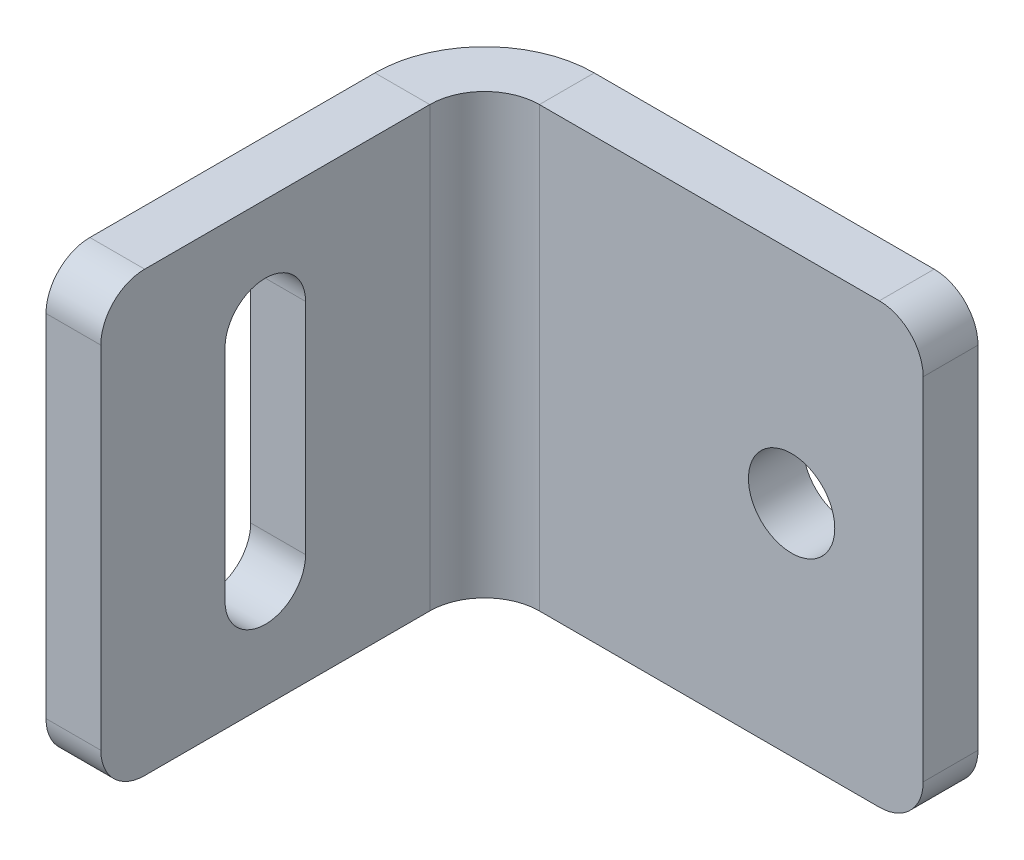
ISO-10303-21;
HEADER;
FILE_DESCRIPTION(('STEP AP214'),'2;1');
FILE_NAME('part.step','',(''),(''),'','','');
FILE_SCHEMA(('AUTOMOTIVE_DESIGN { 1 0 10303 214 1 1 1 1 }'));
ENDSEC;
DATA;
#1=APPLICATION_CONTEXT('core data for automotive mechanical design processes');
#2=APPLICATION_PROTOCOL_DEFINITION('international standard','automotive_design',2000,#1);
#3=PRODUCT_CONTEXT('',#1,'mechanical');
#4=PRODUCT('Part','Part','',(#3));
#5=PRODUCT_RELATED_PRODUCT_CATEGORY('part','',(#4));
#6=PRODUCT_DEFINITION_FORMATION('','',#4);
#7=PRODUCT_DEFINITION_CONTEXT('part definition',#1,'design');
#8=PRODUCT_DEFINITION('design','',#6,#7);
#9=PRODUCT_DEFINITION_SHAPE('','',#8);
#10=(LENGTH_UNIT() NAMED_UNIT(*) SI_UNIT(.MILLI.,.METRE.));
#11=(NAMED_UNIT(*) PLANE_ANGLE_UNIT() SI_UNIT($,.RADIAN.));
#12=(NAMED_UNIT(*) SI_UNIT($,.STERADIAN.) SOLID_ANGLE_UNIT());
#13=UNCERTAINTY_MEASURE_WITH_UNIT(LENGTH_MEASURE(1.E-05),#10,'distance_accuracy_value','');
#14=(GEOMETRIC_REPRESENTATION_CONTEXT(3) GLOBAL_UNCERTAINTY_ASSIGNED_CONTEXT((#13)) GLOBAL_UNIT_ASSIGNED_CONTEXT((#10,
#11,#12)) REPRESENTATION_CONTEXT('',''));
#15=CARTESIAN_POINT('',(0.,0.,0.));
#16=DIRECTION('',(0.,0.,1.));
#17=DIRECTION('',(1.,0.,0.));
#18=AXIS2_PLACEMENT_3D('',#15,#16,#17);
#19=CARTESIAN_POINT('',(11.0458483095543,-22.6108803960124,-3.175));
#20=DIRECTION('',(0.,-1.,0.));
#21=DIRECTION('',(0.,0.,-1.));
#22=AXIS2_PLACEMENT_3D('',#19,#20,#21);
#23=PLANE('',#22);
#24=DIRECTION('',(1.,0.,0.));
#25=VECTOR('',#24,1.);
#26=CARTESIAN_POINT('',(11.0458483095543,-22.6108803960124,-3.175));
#27=LINE('',#26,#25);
#28=CARTESIAN_POINT('',(14.2208483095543,-22.6108803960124,-3.175));
#29=VERTEX_POINT('',#28);
#30=CARTESIAN_POINT('',(33.9058483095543,-22.6108803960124,-3.175));
#31=VERTEX_POINT('',#30);
#32=EDGE_CURVE('E237',#29,#31,#27,.T.);
#33=ORIENTED_EDGE('',*,*,#32,.T.);
#34=DIRECTION('',(0.,0.,1.));
#35=VECTOR('',#34,1.);
#36=CARTESIAN_POINT('',(33.9058483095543,-22.6108803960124,-3.175));
#37=LINE('',#36,#35);
#38=CARTESIAN_POINT('',(33.9058483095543,-22.6108803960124,0.));
#39=VERTEX_POINT('',#38);
#40=EDGE_CURVE('E259',#31,#39,#37,.T.);
#41=ORIENTED_EDGE('',*,*,#40,.T.);
#42=DIRECTION('',(1.,0.,0.));
#43=VECTOR('',#42,1.);
#44=CARTESIAN_POINT('',(11.0458483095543,-22.6108803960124,0.));
#45=LINE('',#44,#43);
#46=CARTESIAN_POINT('',(14.2208483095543,-22.6108803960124,0.));
#47=VERTEX_POINT('',#46);
#48=EDGE_CURVE('E234',#47,#39,#45,.T.);
#49=ORIENTED_EDGE('',*,*,#48,.F.);
#50=DIRECTION('',(0.,0.,-1.));
#51=VECTOR('',#50,1.);
#52=CARTESIAN_POINT('',(14.2208483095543,-22.6108803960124,0.));
#53=LINE('',#52,#51);
#54=EDGE_CURVE('E220',#47,#29,#53,.T.);
#55=ORIENTED_EDGE('',*,*,#54,.T.);
#56=EDGE_LOOP('',(#33,#41,#49,#55));
#57=FACE_BOUND('',#56,.T.);
#58=ADVANCED_FACE('F32',(#57),#23,.T.);
#59=CARTESIAN_POINT('',(11.0458483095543,-22.6108803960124,-3.175));
#60=DIRECTION('',(0.,0.,1.));
#61=DIRECTION('',(1.,0.,0.));
#62=AXIS2_PLACEMENT_3D('',#59,#60,#61);
#63=PLANE('',#62);
#64=CARTESIAN_POINT('',(28.8258483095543,-9.91088039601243,-3.175));
#65=DIRECTION('',(0.,0.,1.));
#66=DIRECTION('',(1.,0.,0.));
#67=AXIS2_PLACEMENT_3D('',#64,#65,#66);
#68=CIRCLE('',#67,2.49999999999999);
#69=CARTESIAN_POINT('',(31.3258483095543,-9.91088039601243,-3.175));
#70=VERTEX_POINT('',#69);
#71=EDGE_CURVE('E183',#70,#70,#68,.T.);
#72=ORIENTED_EDGE('',*,*,#71,.T.);
#73=EDGE_LOOP('',(#72));
#74=FACE_BOUND('',#73,.T.);
#75=DIRECTION('',(0.,1.,0.));
#76=VECTOR('',#75,1.);
#77=CARTESIAN_POINT('',(36.4458483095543,2.78911960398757,-3.175));
#78=LINE('',#77,#76);
#79=CARTESIAN_POINT('',(36.4458483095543,-20.0708803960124,-3.175));
#80=VERTEX_POINT('',#79);
#81=CARTESIAN_POINT('',(36.4458483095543,0.249119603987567,-3.175));
#82=VERTEX_POINT('',#81);
#83=EDGE_CURVE('E240',#80,#82,#78,.T.);
#84=ORIENTED_EDGE('',*,*,#83,.F.);
#85=CARTESIAN_POINT('',(33.9058483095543,-20.0708803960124,-3.175));
#86=DIRECTION('',(0.,0.,1.));
#87=DIRECTION('',(1.,0.,0.));
#88=AXIS2_PLACEMENT_3D('',#85,#86,#87);
#89=CIRCLE('',#88,2.54);
#90=EDGE_CURVE('E273',#80,#31,#89,.F.);
#91=ORIENTED_EDGE('',*,*,#90,.T.);
#92=ORIENTED_EDGE('',*,*,#32,.F.);
#93=DIRECTION('',(0.,-1.,0.));
#94=VECTOR('',#93,1.);
#95=CARTESIAN_POINT('',(14.2208483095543,-22.6108803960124,-3.175));
#96=LINE('',#95,#94);
#97=CARTESIAN_POINT('',(14.2208483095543,2.78911960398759,-3.175));
#98=VERTEX_POINT('',#97);
#99=EDGE_CURVE('E213',#29,#98,#96,.F.);
#100=ORIENTED_EDGE('',*,*,#99,.T.);
#101=DIRECTION('',(-1.,0.,0.));
#102=VECTOR('',#101,1.);
#103=CARTESIAN_POINT('',(11.0458483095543,2.78911960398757,-3.175));
#104=LINE('',#103,#102);
#105=CARTESIAN_POINT('',(33.9058483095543,2.78911960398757,-3.175));
#106=VERTEX_POINT('',#105);
#107=EDGE_CURVE('E244',#106,#98,#104,.T.);
#108=ORIENTED_EDGE('',*,*,#107,.F.);
#109=CARTESIAN_POINT('',(33.9058483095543,0.249119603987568,-3.175));
#110=DIRECTION('',(0.,0.,1.));
#111=DIRECTION('',(1.,0.,0.));
#112=AXIS2_PLACEMENT_3D('',#109,#110,#111);
#113=CIRCLE('',#112,2.54);
#114=EDGE_CURVE('E271',#106,#82,#113,.F.);
#115=ORIENTED_EDGE('',*,*,#114,.T.);
#116=EDGE_LOOP('',(#84,#91,#92,#100,#108,#115));
#117=FACE_BOUND('',#116,.T.);
#118=ADVANCED_FACE('F345',(#74,#117),#63,.F.);
#119=CARTESIAN_POINT('',(11.0458483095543,-22.6108803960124,0.));
#120=DIRECTION('',(0.,0.,1.));
#121=DIRECTION('',(1.,0.,0.));
#122=AXIS2_PLACEMENT_3D('',#119,#120,#121);
#123=PLANE('',#122);
#124=CARTESIAN_POINT('',(28.8258483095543,-9.91088039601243,0.));
#125=DIRECTION('',(0.,0.,1.));
#126=DIRECTION('',(1.,0.,0.));
#127=AXIS2_PLACEMENT_3D('',#124,#125,#126);
#128=CIRCLE('',#127,2.49999999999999);
#129=CARTESIAN_POINT('',(31.3258483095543,-9.91088039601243,0.));
#130=VERTEX_POINT('',#129);
#131=EDGE_CURVE('E180',#130,#130,#128,.T.);
#132=ORIENTED_EDGE('',*,*,#131,.F.);
#133=EDGE_LOOP('',(#132));
#134=FACE_BOUND('',#133,.T.);
#135=ORIENTED_EDGE('',*,*,#48,.T.);
#136=CARTESIAN_POINT('',(33.9058483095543,-20.0708803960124,0.));
#137=DIRECTION('',(0.,0.,1.));
#138=DIRECTION('',(1.,0.,0.));
#139=AXIS2_PLACEMENT_3D('',#136,#137,#138);
#140=CIRCLE('',#139,2.54);
#141=CARTESIAN_POINT('',(36.4458483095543,-20.0708803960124,0.));
#142=VERTEX_POINT('',#141);
#143=EDGE_CURVE('E264',#39,#142,#140,.T.);
#144=ORIENTED_EDGE('',*,*,#143,.T.);
#145=DIRECTION('',(0.,1.,0.));
#146=VECTOR('',#145,1.);
#147=CARTESIAN_POINT('',(36.4458483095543,2.78911960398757,0.));
#148=LINE('',#147,#146);
#149=CARTESIAN_POINT('',(36.4458483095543,0.249119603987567,0.));
#150=VERTEX_POINT('',#149);
#151=EDGE_CURVE('E249',#142,#150,#148,.T.);
#152=ORIENTED_EDGE('',*,*,#151,.T.);
#153=CARTESIAN_POINT('',(33.9058483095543,0.249119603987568,0.));
#154=DIRECTION('',(0.,0.,1.));
#155=DIRECTION('',(1.,0.,0.));
#156=AXIS2_PLACEMENT_3D('',#153,#154,#155);
#157=CIRCLE('',#156,2.54);
#158=CARTESIAN_POINT('',(33.9058483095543,2.78911960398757,0.));
#159=VERTEX_POINT('',#158);
#160=EDGE_CURVE('E262',#150,#159,#157,.T.);
#161=ORIENTED_EDGE('',*,*,#160,.T.);
#162=DIRECTION('',(-1.,0.,0.));
#163=VECTOR('',#162,1.);
#164=CARTESIAN_POINT('',(11.0458483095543,2.78911960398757,0.));
#165=LINE('',#164,#163);
#166=CARTESIAN_POINT('',(14.2208483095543,2.78911960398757,0.));
#167=VERTEX_POINT('',#166);
#168=EDGE_CURVE('E241',#159,#167,#165,.T.);
#169=ORIENTED_EDGE('',*,*,#168,.T.);
#170=DIRECTION('',(0.,-1.,0.));
#171=VECTOR('',#170,1.);
#172=CARTESIAN_POINT('',(14.2208483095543,-22.6108803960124,0.));
#173=LINE('',#172,#171);
#174=EDGE_CURVE('E226',#47,#167,#173,.F.);
#175=ORIENTED_EDGE('',*,*,#174,.F.);
#176=EDGE_LOOP('',(#135,#144,#152,#161,#169,#175));
#177=FACE_BOUND('',#176,.T.);
#178=ADVANCED_FACE('F324',(#134,#177),#123,.T.);
#179=CARTESIAN_POINT('',(11.0458483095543,2.78911960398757,-3.175));
#180=DIRECTION('',(0.,1.,0.));
#181=DIRECTION('',(0.,0.,1.));
#182=AXIS2_PLACEMENT_3D('',#179,#180,#181);
#183=PLANE('',#182);
#184=ORIENTED_EDGE('',*,*,#168,.F.);
#185=DIRECTION('',(0.,0.,1.));
#186=VECTOR('',#185,1.);
#187=CARTESIAN_POINT('',(33.9058483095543,2.78911960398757,-3.175));
#188=LINE('',#187,#186);
#189=EDGE_CURVE('E275',#159,#106,#188,.F.);
#190=ORIENTED_EDGE('',*,*,#189,.T.);
#191=ORIENTED_EDGE('',*,*,#107,.T.);
#192=DIRECTION('',(0.,0.,-1.));
#193=VECTOR('',#192,1.);
#194=CARTESIAN_POINT('',(14.2208483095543,2.78911960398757,0.));
#195=LINE('',#194,#193);
#196=EDGE_CURVE('E231',#167,#98,#195,.T.);
#197=ORIENTED_EDGE('',*,*,#196,.F.);
#198=EDGE_LOOP('',(#184,#190,#191,#197));
#199=FACE_BOUND('',#198,.T.);
#200=ADVANCED_FACE('F342',(#199),#183,.T.);
#201=CARTESIAN_POINT('',(36.4458483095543,2.78911960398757,-3.175));
#202=DIRECTION('',(1.,0.,0.));
#203=DIRECTION('',(0.,1.,0.));
#204=AXIS2_PLACEMENT_3D('',#201,#202,#203);
#205=PLANE('',#204);
#206=ORIENTED_EDGE('',*,*,#151,.F.);
#207=DIRECTION('',(0.,0.,1.));
#208=VECTOR('',#207,1.);
#209=CARTESIAN_POINT('',(36.4458483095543,-20.0708803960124,-3.175));
#210=LINE('',#209,#208);
#211=EDGE_CURVE('E269',#142,#80,#210,.F.);
#212=ORIENTED_EDGE('',*,*,#211,.T.);
#213=ORIENTED_EDGE('',*,*,#83,.T.);
#214=DIRECTION('',(0.,0.,1.));
#215=VECTOR('',#214,1.);
#216=CARTESIAN_POINT('',(36.4458483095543,0.249119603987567,-3.175));
#217=LINE('',#216,#215);
#218=EDGE_CURVE('E266',#82,#150,#217,.T.);
#219=ORIENTED_EDGE('',*,*,#218,.T.);
#220=EDGE_LOOP('',(#206,#212,#213,#219));
#221=FACE_BOUND('',#220,.T.);
#222=ADVANCED_FACE('F334',(#221),#205,.T.);
#223=CARTESIAN_POINT('',(14.2208483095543,2.78911960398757,3.175));
#224=DIRECTION('',(0.,1.,0.));
#225=DIRECTION('',(0.,0.,1.));
#226=AXIS2_PLACEMENT_3D('',#223,#224,#225);
#227=PLANE('',#226);
#228=DIRECTION('',(-1.,0.,0.));
#229=VECTOR('',#228,1.);
#230=CARTESIAN_POINT('',(11.0458483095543,2.78911960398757,3.17499999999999));
#231=LINE('',#230,#229);
#232=CARTESIAN_POINT('',(11.0458483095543,2.78911960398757,3.17499999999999));
#233=VERTEX_POINT('',#232);
#234=CARTESIAN_POINT('',(7.8708483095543,2.78911960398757,3.17499999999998));
#235=VERTEX_POINT('',#234);
#236=EDGE_CURVE('E186',#233,#235,#231,.T.);
#237=ORIENTED_EDGE('',*,*,#236,.F.);
#238=CARTESIAN_POINT('',(14.2208483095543,2.78911960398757,3.175));
#239=DIRECTION('',(0.,-1.,0.));
#240=DIRECTION('',(0.,0.,-1.));
#241=AXIS2_PLACEMENT_3D('',#238,#239,#240);
#242=CIRCLE('',#241,3.175);
#243=EDGE_CURVE('E223',#167,#233,#242,.F.);
#244=ORIENTED_EDGE('',*,*,#243,.F.);
#245=ORIENTED_EDGE('',*,*,#196,.T.);
#246=CARTESIAN_POINT('',(14.2208483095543,2.78911960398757,3.175));
#247=DIRECTION('',(0.,-1.,0.));
#248=DIRECTION('',(0.,0.,-1.));
#249=AXIS2_PLACEMENT_3D('',#246,#247,#248);
#250=CIRCLE('',#249,6.35);
#251=EDGE_CURVE('E216',#98,#235,#250,.F.);
#252=ORIENTED_EDGE('',*,*,#251,.T.);
#253=EDGE_LOOP('',(#237,#244,#245,#252));
#254=FACE_BOUND('',#253,.T.);
#255=ADVANCED_FACE('F313',(#254),#227,.T.);
#256=CARTESIAN_POINT('',(14.2208483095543,-22.6108803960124,3.175));
#257=DIRECTION('',(0.,1.,0.));
#258=DIRECTION('',(0.,0.,1.));
#259=AXIS2_PLACEMENT_3D('',#256,#257,#258);
#260=PLANE('',#259);
#261=CARTESIAN_POINT('',(14.2208483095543,-22.6108803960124,3.175));
#262=DIRECTION('',(0.,-1.,0.));
#263=DIRECTION('',(0.,0.,-1.));
#264=AXIS2_PLACEMENT_3D('',#261,#262,#263);
#265=CIRCLE('',#264,3.175);
#266=CARTESIAN_POINT('',(11.0458483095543,-22.6108803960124,3.17499999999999));
#267=VERTEX_POINT('',#266);
#268=EDGE_CURVE('E207',#267,#47,#265,.T.);
#269=ORIENTED_EDGE('',*,*,#268,.F.);
#270=DIRECTION('',(-1.,0.,0.));
#271=VECTOR('',#270,1.);
#272=CARTESIAN_POINT('',(11.0458483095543,-22.6108803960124,3.17499999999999));
#273=LINE('',#272,#271);
#274=CARTESIAN_POINT('',(7.8708483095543,-22.6108803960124,3.17499999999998));
#275=VERTEX_POINT('',#274);
#276=EDGE_CURVE('E191',#267,#275,#273,.T.);
#277=ORIENTED_EDGE('',*,*,#276,.T.);
#278=CARTESIAN_POINT('',(14.2208483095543,-22.6108803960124,3.175));
#279=DIRECTION('',(0.,-1.,0.));
#280=DIRECTION('',(0.,0.,-1.));
#281=AXIS2_PLACEMENT_3D('',#278,#279,#280);
#282=CIRCLE('',#281,6.35);
#283=EDGE_CURVE('E217',#275,#29,#282,.T.);
#284=ORIENTED_EDGE('',*,*,#283,.T.);
#285=ORIENTED_EDGE('',*,*,#54,.F.);
#286=EDGE_LOOP('',(#269,#277,#284,#285));
#287=FACE_BOUND('',#286,.T.);
#288=ADVANCED_FACE('F305',(#287),#260,.F.);
#289=CARTESIAN_POINT('',(14.2208483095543,-22.6108803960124,3.175));
#290=DIRECTION('',(0.,-1.,0.));
#291=DIRECTION('',(-1.,0.,0.));
#292=AXIS2_PLACEMENT_3D('',#289,#290,#291);
#293=CYLINDRICAL_SURFACE('',#292,6.35);
#294=ORIENTED_EDGE('',*,*,#99,.F.);
#295=ORIENTED_EDGE('',*,*,#283,.F.);
#296=DIRECTION('',(0.,1.,0.));
#297=VECTOR('',#296,1.);
#298=CARTESIAN_POINT('',(7.8708483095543,-22.6108803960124,3.17499999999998));
#299=LINE('',#298,#297);
#300=EDGE_CURVE('E194',#275,#235,#299,.T.);
#301=ORIENTED_EDGE('',*,*,#300,.T.);
#302=ORIENTED_EDGE('',*,*,#251,.F.);
#303=EDGE_LOOP('',(#294,#295,#301,#302));
#304=FACE_BOUND('',#303,.T.);
#305=ADVANCED_FACE('F310',(#304),#293,.T.);
#306=CARTESIAN_POINT('',(14.2208483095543,-22.6108803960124,3.175));
#307=DIRECTION('',(0.,-1.,0.));
#308=DIRECTION('',(-1.,0.,0.));
#309=AXIS2_PLACEMENT_3D('',#306,#307,#308);
#310=CYLINDRICAL_SURFACE('',#309,3.175);
#311=ORIENTED_EDGE('',*,*,#174,.T.);
#312=ORIENTED_EDGE('',*,*,#243,.T.);
#313=DIRECTION('',(0.,-1.,0.));
#314=VECTOR('',#313,1.);
#315=CARTESIAN_POINT('',(11.0458483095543,2.78911960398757,3.17499999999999));
#316=LINE('',#315,#314);
#317=EDGE_CURVE('E189',#233,#267,#316,.T.);
#318=ORIENTED_EDGE('',*,*,#317,.T.);
#319=ORIENTED_EDGE('',*,*,#268,.T.);
#320=EDGE_LOOP('',(#311,#312,#318,#319));
#321=FACE_BOUND('',#320,.T.);
#322=ADVANCED_FACE('F321',(#321),#310,.F.);
#323=CARTESIAN_POINT('',(7.87084830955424,-22.6108803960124,22.225));
#324=DIRECTION('',(0.,1.,0.));
#325=DIRECTION('',(0.,0.,1.));
#326=AXIS2_PLACEMENT_3D('',#323,#324,#325);
#327=PLANE('',#326);
#328=DIRECTION('',(0.,0.,1.));
#329=VECTOR('',#328,1.);
#330=CARTESIAN_POINT('',(11.0458483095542,-22.6108803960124,22.225));
#331=LINE('',#330,#329);
#332=CARTESIAN_POINT('',(11.0458483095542,-22.6108803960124,19.685));
#333=VERTEX_POINT('',#332);
#334=EDGE_CURVE('E199',#267,#333,#331,.T.);
#335=ORIENTED_EDGE('',*,*,#334,.T.);
#336=DIRECTION('',(1.,0.,0.));
#337=VECTOR('',#336,1.);
#338=CARTESIAN_POINT('',(7.87084830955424,-22.6108803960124,19.685));
#339=LINE('',#338,#337);
#340=CARTESIAN_POINT('',(7.87084830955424,-22.6108803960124,19.685));
#341=VERTEX_POINT('',#340);
#342=EDGE_CURVE('E55',#333,#341,#339,.F.);
#343=ORIENTED_EDGE('',*,*,#342,.T.);
#344=DIRECTION('',(0.,0.,1.));
#345=VECTOR('',#344,1.);
#346=CARTESIAN_POINT('',(7.87084830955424,-22.6108803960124,22.225));
#347=LINE('',#346,#345);
#348=EDGE_CURVE('E200',#275,#341,#347,.T.);
#349=ORIENTED_EDGE('',*,*,#348,.F.);
#350=ORIENTED_EDGE('',*,*,#276,.F.);
#351=EDGE_LOOP('',(#335,#343,#349,#350));
#352=FACE_BOUND('',#351,.T.);
#353=ADVANCED_FACE('F302',(#352),#327,.F.);
#354=CARTESIAN_POINT('',(7.87084830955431,2.78911960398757,0.));
#355=DIRECTION('',(0.,-1.,0.));
#356=DIRECTION('',(0.,0.,-1.));
#357=AXIS2_PLACEMENT_3D('',#354,#355,#356);
#358=PLANE('',#357);
#359=DIRECTION('',(0.,0.,-1.));
#360=VECTOR('',#359,1.);
#361=CARTESIAN_POINT('',(7.87084830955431,2.78911960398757,0.));
#362=LINE('',#361,#360);
#363=CARTESIAN_POINT('',(7.87084830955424,2.78911960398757,19.685));
#364=VERTEX_POINT('',#363);
#365=EDGE_CURVE('E205',#364,#235,#362,.T.);
#366=ORIENTED_EDGE('',*,*,#365,.F.);
#367=DIRECTION('',(1.,0.,0.));
#368=VECTOR('',#367,1.);
#369=CARTESIAN_POINT('',(7.87084830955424,2.78911960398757,19.685));
#370=LINE('',#369,#368);
#371=CARTESIAN_POINT('',(11.0458483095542,2.78911960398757,19.685));
#372=VERTEX_POINT('',#371);
#373=EDGE_CURVE('E11',#364,#372,#370,.T.);
#374=ORIENTED_EDGE('',*,*,#373,.T.);
#375=DIRECTION('',(0.,0.,-1.));
#376=VECTOR('',#375,1.);
#377=CARTESIAN_POINT('',(11.0458483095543,2.78911960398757,0.));
#378=LINE('',#377,#376);
#379=EDGE_CURVE('E203',#372,#233,#378,.T.);
#380=ORIENTED_EDGE('',*,*,#379,.T.);
#381=ORIENTED_EDGE('',*,*,#236,.T.);
#382=EDGE_LOOP('',(#366,#374,#380,#381));
#383=FACE_BOUND('',#382,.T.);
#384=ADVANCED_FACE('F317',(#383),#358,.F.);
#385=CARTESIAN_POINT('',(7.87084830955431,-22.6108803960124,0.));
#386=DIRECTION('',(1.,0.,0.));
#387=DIRECTION('',(0.,0.,-1.));
#388=AXIS2_PLACEMENT_3D('',#385,#386,#387);
#389=PLANE('',#388);
#390=DIRECTION('',(0.,-1.,0.));
#391=VECTOR('',#390,1.);
#392=CARTESIAN_POINT('',(7.87084830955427,-3.48822162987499,10.3675520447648));
#393=LINE('',#392,#391);
#394=CARTESIAN_POINT('',(7.87084830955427,-3.48822162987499,10.3675520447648));
#395=VERTEX_POINT('',#394);
#396=CARTESIAN_POINT('',(7.87084830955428,-16.188221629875,10.3675520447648));
#397=VERTEX_POINT('',#396);
#398=EDGE_CURVE('E164',#395,#397,#393,.T.);
#399=ORIENTED_EDGE('',*,*,#398,.F.);
#400=CARTESIAN_POINT('',(7.87084830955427,-3.48822162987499,12.7000000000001));
#401=DIRECTION('',(-1.,0.,0.));
#402=DIRECTION('',(0.,0.,1.));
#403=AXIS2_PLACEMENT_3D('',#400,#401,#402);
#404=CIRCLE('',#403,2.33244795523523);
#405=CARTESIAN_POINT('',(7.87084830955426,-3.48822162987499,15.0324479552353));
#406=VERTEX_POINT('',#405);
#407=EDGE_CURVE('E169',#406,#395,#404,.T.);
#408=ORIENTED_EDGE('',*,*,#407,.F.);
#409=DIRECTION('',(0.,1.,0.));
#410=VECTOR('',#409,1.);
#411=CARTESIAN_POINT('',(7.87084830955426,-3.48822162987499,15.0324479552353));
#412=LINE('',#411,#410);
#413=CARTESIAN_POINT('',(7.87084830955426,-16.188221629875,15.0324479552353));
#414=VERTEX_POINT('',#413);
#415=EDGE_CURVE('E173',#414,#406,#412,.T.);
#416=ORIENTED_EDGE('',*,*,#415,.F.);
#417=CARTESIAN_POINT('',(7.87084830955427,-16.188221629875,12.7000000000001));
#418=DIRECTION('',(-1.,0.,0.));
#419=DIRECTION('',(0.,0.,1.));
#420=AXIS2_PLACEMENT_3D('',#417,#418,#419);
#421=CIRCLE('',#420,2.33244795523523);
#422=EDGE_CURVE('E153',#397,#414,#421,.T.);
#423=ORIENTED_EDGE('',*,*,#422,.F.);
#424=EDGE_LOOP('',(#399,#408,#416,#423));
#425=FACE_BOUND('',#424,.T.);
#426=ORIENTED_EDGE('',*,*,#348,.T.);
#427=CARTESIAN_POINT('',(7.87084830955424,-20.0708803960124,19.685));
#428=DIRECTION('',(1.,0.,0.));
#429=DIRECTION('',(0.,0.,-1.));
#430=AXIS2_PLACEMENT_3D('',#427,#428,#429);
#431=CIRCLE('',#430,2.54);
#432=CARTESIAN_POINT('',(7.87084830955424,-20.0708803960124,22.225));
#433=VERTEX_POINT('',#432);
#434=EDGE_CURVE('E40',#341,#433,#431,.F.);
#435=ORIENTED_EDGE('',*,*,#434,.T.);
#436=DIRECTION('',(0.,1.,0.));
#437=VECTOR('',#436,1.);
#438=CARTESIAN_POINT('',(7.87084830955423,2.78911960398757,22.225));
#439=LINE('',#438,#437);
#440=CARTESIAN_POINT('',(7.87084830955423,0.24911960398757,22.225));
#441=VERTEX_POINT('',#440);
#442=EDGE_CURVE('E202',#433,#441,#439,.T.);
#443=ORIENTED_EDGE('',*,*,#442,.T.);
#444=CARTESIAN_POINT('',(7.87084830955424,0.24911960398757,19.685));
#445=DIRECTION('',(1.,0.,0.));
#446=DIRECTION('',(0.,0.,-1.));
#447=AXIS2_PLACEMENT_3D('',#444,#445,#446);
#448=CIRCLE('',#447,2.54);
#449=EDGE_CURVE('E47',#441,#364,#448,.F.);
#450=ORIENTED_EDGE('',*,*,#449,.T.);
#451=ORIENTED_EDGE('',*,*,#365,.T.);
#452=ORIENTED_EDGE('',*,*,#300,.F.);
#453=EDGE_LOOP('',(#426,#435,#443,#450,#451,#452));
#454=FACE_BOUND('',#453,.T.);
#455=ADVANCED_FACE('F171',(#425,#454),#389,.F.);
#456=CARTESIAN_POINT('',(11.0458483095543,-22.6108803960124,0.));
#457=DIRECTION('',(1.,0.,0.));
#458=DIRECTION('',(0.,0.,-1.));
#459=AXIS2_PLACEMENT_3D('',#456,#457,#458);
#460=PLANE('',#459);
#461=CARTESIAN_POINT('',(11.0458483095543,-3.48822162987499,12.7000000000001));
#462=DIRECTION('',(1.,0.,0.));
#463=DIRECTION('',(0.,0.,-1.));
#464=AXIS2_PLACEMENT_3D('',#461,#462,#463);
#465=CIRCLE('',#464,2.33244795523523);
#466=CARTESIAN_POINT('',(11.0458483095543,-3.48822162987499,10.3675520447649));
#467=VERTEX_POINT('',#466);
#468=CARTESIAN_POINT('',(11.0458483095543,-3.48822162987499,15.0324479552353));
#469=VERTEX_POINT('',#468);
#470=EDGE_CURVE('E257',#467,#469,#465,.T.);
#471=ORIENTED_EDGE('',*,*,#470,.F.);
#472=DIRECTION('',(0.,1.,0.));
#473=VECTOR('',#472,1.);
#474=CARTESIAN_POINT('',(11.0458483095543,-22.6108803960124,10.3675520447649));
#475=LINE('',#474,#473);
#476=CARTESIAN_POINT('',(11.0458483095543,-16.188221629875,10.3675520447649));
#477=VERTEX_POINT('',#476);
#478=EDGE_CURVE('E246',#477,#467,#475,.T.);
#479=ORIENTED_EDGE('',*,*,#478,.F.);
#480=CARTESIAN_POINT('',(11.0458483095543,-16.188221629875,12.7000000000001));
#481=DIRECTION('',(1.,0.,0.));
#482=DIRECTION('',(0.,0.,-1.));
#483=AXIS2_PLACEMENT_3D('',#480,#481,#482);
#484=CIRCLE('',#483,2.33244795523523);
#485=CARTESIAN_POINT('',(11.0458483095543,-16.188221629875,15.0324479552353));
#486=VERTEX_POINT('',#485);
#487=EDGE_CURVE('E156',#486,#477,#484,.T.);
#488=ORIENTED_EDGE('',*,*,#487,.F.);
#489=DIRECTION('',(0.,-1.,0.));
#490=VECTOR('',#489,1.);
#491=CARTESIAN_POINT('',(11.0458483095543,-22.6108803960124,15.0324479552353));
#492=LINE('',#491,#490);
#493=EDGE_CURVE('E255',#469,#486,#492,.T.);
#494=ORIENTED_EDGE('',*,*,#493,.F.);
#495=EDGE_LOOP('',(#471,#479,#488,#494));
#496=FACE_BOUND('',#495,.T.);
#497=DIRECTION('',(0.,1.,0.));
#498=VECTOR('',#497,1.);
#499=CARTESIAN_POINT('',(11.0458483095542,2.78911960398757,22.225));
#500=LINE('',#499,#498);
#501=CARTESIAN_POINT('',(11.0458483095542,-20.0708803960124,22.225));
#502=VERTEX_POINT('',#501);
#503=CARTESIAN_POINT('',(11.0458483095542,0.249119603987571,22.225));
#504=VERTEX_POINT('',#503);
#505=EDGE_CURVE('E209',#502,#504,#500,.T.);
#506=ORIENTED_EDGE('',*,*,#505,.F.);
#507=CARTESIAN_POINT('',(11.0458483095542,-20.0708803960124,19.685));
#508=DIRECTION('',(1.,0.,0.));
#509=DIRECTION('',(0.,0.,-1.));
#510=AXIS2_PLACEMENT_3D('',#507,#508,#509);
#511=CIRCLE('',#510,2.54);
#512=EDGE_CURVE('E284',#502,#333,#511,.T.);
#513=ORIENTED_EDGE('',*,*,#512,.T.);
#514=ORIENTED_EDGE('',*,*,#334,.F.);
#515=ORIENTED_EDGE('',*,*,#317,.F.);
#516=ORIENTED_EDGE('',*,*,#379,.F.);
#517=CARTESIAN_POINT('',(11.0458483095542,0.249119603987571,19.685));
#518=DIRECTION('',(1.,0.,0.));
#519=DIRECTION('',(0.,0.,-1.));
#520=AXIS2_PLACEMENT_3D('',#517,#518,#519);
#521=CIRCLE('',#520,2.54);
#522=EDGE_CURVE('E282',#372,#504,#521,.T.);
#523=ORIENTED_EDGE('',*,*,#522,.T.);
#524=EDGE_LOOP('',(#506,#513,#514,#515,#516,#523));
#525=FACE_BOUND('',#524,.T.);
#526=ADVANCED_FACE('F299',(#496,#525),#460,.T.);
#527=CARTESIAN_POINT('',(7.87084830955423,2.78911960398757,22.225));
#528=DIRECTION('',(0.,0.,-1.));
#529=DIRECTION('',(-1.,0.,0.));
#530=AXIS2_PLACEMENT_3D('',#527,#528,#529);
#531=PLANE('',#530);
#532=ORIENTED_EDGE('',*,*,#442,.F.);
#533=DIRECTION('',(1.,0.,0.));
#534=VECTOR('',#533,1.);
#535=CARTESIAN_POINT('',(7.87084830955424,-20.0708803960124,22.225));
#536=LINE('',#535,#534);
#537=EDGE_CURVE('E279',#433,#502,#536,.T.);
#538=ORIENTED_EDGE('',*,*,#537,.T.);
#539=ORIENTED_EDGE('',*,*,#505,.T.);
#540=DIRECTION('',(1.,0.,0.));
#541=VECTOR('',#540,1.);
#542=CARTESIAN_POINT('',(7.87084830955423,0.24911960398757,22.225));
#543=LINE('',#542,#541);
#544=EDGE_CURVE('E277',#504,#441,#543,.F.);
#545=ORIENTED_EDGE('',*,*,#544,.T.);
#546=EDGE_LOOP('',(#532,#538,#539,#545));
#547=FACE_BOUND('',#546,.T.);
#548=ADVANCED_FACE('F293',(#547),#531,.F.);
#549=CARTESIAN_POINT('',(28.8258483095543,-9.91088039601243,-3.175));
#550=DIRECTION('',(0.,0.,1.));
#551=DIRECTION('',(1.,0.,0.));
#552=AXIS2_PLACEMENT_3D('',#549,#550,#551);
#553=CYLINDRICAL_SURFACE('',#552,2.49999999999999);
#554=ORIENTED_EDGE('',*,*,#71,.F.);
#555=EDGE_LOOP('',(#554));
#556=FACE_BOUND('',#555,.T.);
#557=ORIENTED_EDGE('',*,*,#131,.T.);
#558=EDGE_LOOP('',(#557));
#559=FACE_BOUND('',#558,.T.);
#560=ADVANCED_FACE('F400',(#556,#559),#553,.F.);
#561=CARTESIAN_POINT('',(36.4458483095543,-3.48822162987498,12.7000000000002));
#562=DIRECTION('',(-1.,0.,0.));
#563=DIRECTION('',(0.,0.,1.));
#564=AXIS2_PLACEMENT_3D('',#561,#562,#563);
#565=CYLINDRICAL_SURFACE('',#564,2.33244795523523);
#566=ORIENTED_EDGE('',*,*,#470,.T.);
#567=DIRECTION('',(-1.,0.,0.));
#568=VECTOR('',#567,1.);
#569=CARTESIAN_POINT('',(36.4458483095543,-3.48822162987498,15.0324479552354));
#570=LINE('',#569,#568);
#571=EDGE_CURVE('E178',#469,#406,#570,.T.);
#572=ORIENTED_EDGE('',*,*,#571,.T.);
#573=ORIENTED_EDGE('',*,*,#407,.T.);
#574=DIRECTION('',(-1.,0.,0.));
#575=VECTOR('',#574,1.);
#576=CARTESIAN_POINT('',(36.4458483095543,-3.48822162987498,10.3675520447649));
#577=LINE('',#576,#575);
#578=EDGE_CURVE('E160',#467,#395,#577,.T.);
#579=ORIENTED_EDGE('',*,*,#578,.F.);
#580=EDGE_LOOP('',(#566,#572,#573,#579));
#581=FACE_BOUND('',#580,.T.);
#582=ADVANCED_FACE('F498',(#581),#565,.F.);
#583=CARTESIAN_POINT('',(36.4458483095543,-3.48822162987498,15.0324479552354));
#584=DIRECTION('',(0.,0.,1.));
#585=DIRECTION('',(1.,0.,0.));
#586=AXIS2_PLACEMENT_3D('',#583,#584,#585);
#587=PLANE('',#586);
#588=ORIENTED_EDGE('',*,*,#493,.T.);
#589=DIRECTION('',(-1.,0.,0.));
#590=VECTOR('',#589,1.);
#591=CARTESIAN_POINT('',(36.4458483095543,-16.188221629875,15.0324479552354));
#592=LINE('',#591,#590);
#593=EDGE_CURVE('E159',#486,#414,#592,.T.);
#594=ORIENTED_EDGE('',*,*,#593,.T.);
#595=ORIENTED_EDGE('',*,*,#415,.T.);
#596=ORIENTED_EDGE('',*,*,#571,.F.);
#597=EDGE_LOOP('',(#588,#594,#595,#596));
#598=FACE_BOUND('',#597,.T.);
#599=ADVANCED_FACE('F489',(#598),#587,.F.);
#600=CARTESIAN_POINT('',(36.4458483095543,-16.188221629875,12.7000000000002));
#601=DIRECTION('',(-1.,0.,0.));
#602=DIRECTION('',(0.,0.,1.));
#603=AXIS2_PLACEMENT_3D('',#600,#601,#602);
#604=CYLINDRICAL_SURFACE('',#603,2.33244795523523);
#605=ORIENTED_EDGE('',*,*,#487,.T.);
#606=DIRECTION('',(-1.,0.,0.));
#607=VECTOR('',#606,1.);
#608=CARTESIAN_POINT('',(36.4458483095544,-16.188221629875,10.3675520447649));
#609=LINE('',#608,#607);
#610=EDGE_CURVE('E148',#477,#397,#609,.T.);
#611=ORIENTED_EDGE('',*,*,#610,.T.);
#612=ORIENTED_EDGE('',*,*,#422,.T.);
#613=ORIENTED_EDGE('',*,*,#593,.F.);
#614=EDGE_LOOP('',(#605,#611,#612,#613));
#615=FACE_BOUND('',#614,.T.);
#616=ADVANCED_FACE('F150',(#615),#604,.F.);
#617=CARTESIAN_POINT('',(36.4458483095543,-3.48822162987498,10.3675520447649));
#618=DIRECTION('',(0.,0.,-1.));
#619=DIRECTION('',(-1.,0.,0.));
#620=AXIS2_PLACEMENT_3D('',#617,#618,#619);
#621=PLANE('',#620);
#622=ORIENTED_EDGE('',*,*,#478,.T.);
#623=ORIENTED_EDGE('',*,*,#578,.T.);
#624=ORIENTED_EDGE('',*,*,#398,.T.);
#625=ORIENTED_EDGE('',*,*,#610,.F.);
#626=EDGE_LOOP('',(#622,#623,#624,#625));
#627=FACE_BOUND('',#626,.T.);
#628=ADVANCED_FACE('F165',(#627),#621,.F.);
#629=CARTESIAN_POINT('',(33.9058483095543,-20.0708803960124,-3.175));
#630=DIRECTION('',(0.,0.,1.));
#631=DIRECTION('',(1.,0.,0.));
#632=AXIS2_PLACEMENT_3D('',#629,#630,#631);
#633=CYLINDRICAL_SURFACE('',#632,2.54);
#634=ORIENTED_EDGE('',*,*,#90,.F.);
#635=ORIENTED_EDGE('',*,*,#211,.F.);
#636=ORIENTED_EDGE('',*,*,#143,.F.);
#637=ORIENTED_EDGE('',*,*,#40,.F.);
#638=EDGE_LOOP('',(#634,#635,#636,#637));
#639=FACE_BOUND('',#638,.T.);
#640=ADVANCED_FACE('F330',(#639),#633,.T.);
#641=CARTESIAN_POINT('',(33.9058483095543,0.249119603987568,-3.175));
#642=DIRECTION('',(0.,0.,1.));
#643=DIRECTION('',(1.,0.,0.));
#644=AXIS2_PLACEMENT_3D('',#641,#642,#643);
#645=CYLINDRICAL_SURFACE('',#644,2.54);
#646=ORIENTED_EDGE('',*,*,#114,.F.);
#647=ORIENTED_EDGE('',*,*,#189,.F.);
#648=ORIENTED_EDGE('',*,*,#160,.F.);
#649=ORIENTED_EDGE('',*,*,#218,.F.);
#650=EDGE_LOOP('',(#646,#647,#648,#649));
#651=FACE_BOUND('',#650,.T.);
#652=ADVANCED_FACE('F339',(#651),#645,.T.);
#653=CARTESIAN_POINT('',(7.87084830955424,-20.0708803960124,19.685));
#654=DIRECTION('',(1.,0.,0.));
#655=DIRECTION('',(0.,0.,-1.));
#656=AXIS2_PLACEMENT_3D('',#653,#654,#655);
#657=CYLINDRICAL_SURFACE('',#656,2.54);
#658=ORIENTED_EDGE('',*,*,#434,.F.);
#659=ORIENTED_EDGE('',*,*,#342,.F.);
#660=ORIENTED_EDGE('',*,*,#512,.F.);
#661=ORIENTED_EDGE('',*,*,#537,.F.);
#662=EDGE_LOOP('',(#658,#659,#660,#661));
#663=FACE_BOUND('',#662,.T.);
#664=ADVANCED_FACE('F296',(#663),#657,.T.);
#665=CARTESIAN_POINT('',(7.87084830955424,0.24911960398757,19.685));
#666=DIRECTION('',(1.,0.,0.));
#667=DIRECTION('',(0.,0.,-1.));
#668=AXIS2_PLACEMENT_3D('',#665,#666,#667);
#669=CYLINDRICAL_SURFACE('',#668,2.54);
#670=ORIENTED_EDGE('',*,*,#449,.F.);
#671=ORIENTED_EDGE('',*,*,#544,.F.);
#672=ORIENTED_EDGE('',*,*,#522,.F.);
#673=ORIENTED_EDGE('',*,*,#373,.F.);
#674=EDGE_LOOP('',(#670,#671,#672,#673));
#675=FACE_BOUND('',#674,.T.);
#676=ADVANCED_FACE('F34',(#675),#669,.T.);
#677=CLOSED_SHELL('',(#58,#118,#178,#200,#222,#255,#288,#305,#322,#353,#384,#455,#526,#548,#560,
#582,#599,#616,#628,#640,#652,#664,#676));
#678=MANIFOLD_SOLID_BREP('B2',#677);
#679=ADVANCED_BREP_SHAPE_REPRESENTATION('',(#18,#678),#14);
#680=SHAPE_DEFINITION_REPRESENTATION(#9,#679);
ENDSEC;
END-ISO-10303-21;
